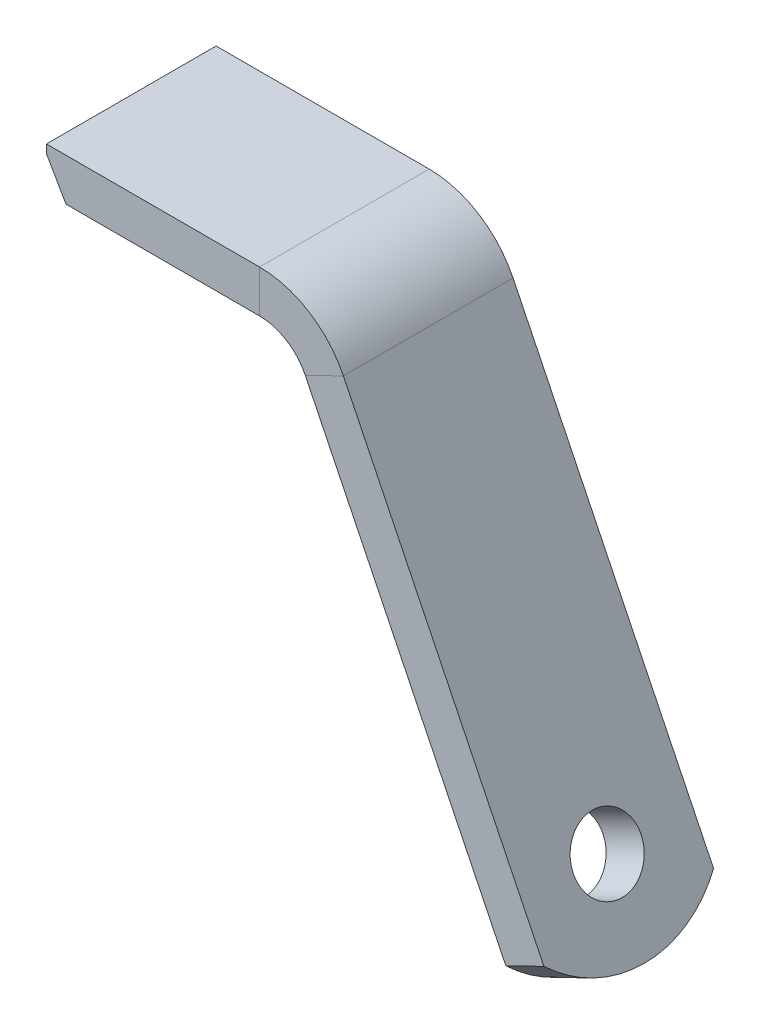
ISO-10303-21;
HEADER;
FILE_DESCRIPTION(('STEP AP214'),'2;1');
FILE_NAME('part.step','',(''),(''),'','','');
FILE_SCHEMA(('AUTOMOTIVE_DESIGN { 1 0 10303 214 1 1 1 1 }'));
ENDSEC;
DATA;
#1=APPLICATION_CONTEXT('core data for automotive mechanical design processes');
#2=APPLICATION_PROTOCOL_DEFINITION('international standard','automotive_design',2000,#1);
#3=PRODUCT_CONTEXT('',#1,'mechanical');
#4=PRODUCT('Part','Part','',(#3));
#5=PRODUCT_RELATED_PRODUCT_CATEGORY('part','',(#4));
#6=PRODUCT_DEFINITION_FORMATION('','',#4);
#7=PRODUCT_DEFINITION_CONTEXT('part definition',#1,'design');
#8=PRODUCT_DEFINITION('design','',#6,#7);
#9=PRODUCT_DEFINITION_SHAPE('','',#8);
#10=(LENGTH_UNIT() NAMED_UNIT(*) SI_UNIT(.MILLI.,.METRE.));
#11=(NAMED_UNIT(*) PLANE_ANGLE_UNIT() SI_UNIT($,.RADIAN.));
#12=(NAMED_UNIT(*) SI_UNIT($,.STERADIAN.) SOLID_ANGLE_UNIT());
#13=UNCERTAINTY_MEASURE_WITH_UNIT(LENGTH_MEASURE(1.E-05),#10,'distance_accuracy_value','');
#14=(GEOMETRIC_REPRESENTATION_CONTEXT(3) GLOBAL_UNCERTAINTY_ASSIGNED_CONTEXT((#13)) GLOBAL_UNIT_ASSIGNED_CONTEXT((#10,
#11,#12)) REPRESENTATION_CONTEXT('',''));
#15=CARTESIAN_POINT('',(0.,0.,0.));
#16=DIRECTION('',(0.,0.,1.));
#17=DIRECTION('',(1.,0.,0.));
#18=AXIS2_PLACEMENT_3D('',#15,#16,#17);
#19=CARTESIAN_POINT('',(27.5060297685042,-2.19185573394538,10.));
#20=DIRECTION('',(0.898794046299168,0.438371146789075,0.));
#21=DIRECTION('',(-0.438371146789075,0.898794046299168,0.));
#22=AXIS2_PLACEMENT_3D('',#19,#20,#21);
#23=PLANE('',#22);
#24=CARTESIAN_POINT('',(51.6164428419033,-51.6255282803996,0.));
#25=DIRECTION('',(0.898794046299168,0.438371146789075,0.));
#26=DIRECTION('',(-0.438371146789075,0.898794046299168,0.));
#27=AXIS2_PLACEMENT_3D('',#24,#25,#26);
#28=CIRCLE('',#27,4.);
#29=CARTESIAN_POINT('',(49.862958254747,-48.030352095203,0.));
#30=VERTEX_POINT('',#29);
#31=EDGE_CURVE('E124',#30,#30,#28,.T.);
#32=ORIENTED_EDGE('',*,*,#31,.T.);
#33=EDGE_LOOP('',(#32));
#34=FACE_BOUND('',#33,.T.);
#35=CARTESIAN_POINT('',(49.862958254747,-48.030352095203,0.));
#36=DIRECTION('',(0.898794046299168,0.438371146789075,0.));
#37=DIRECTION('',(-0.438371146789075,0.898794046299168,0.));
#38=AXIS2_PLACEMENT_3D('',#35,#36,#37);
#39=CIRCLE('',#38,14.);
#40=CARTESIAN_POINT('',(54.1581007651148,-56.8366992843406,-10.));
#41=VERTEX_POINT('',#40);
#42=CARTESIAN_POINT('',(54.1581007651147,-56.8366992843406,10.));
#43=VERTEX_POINT('',#42);
#44=EDGE_CURVE('E105',#41,#43,#39,.F.);
#45=ORIENTED_EDGE('',*,*,#44,.T.);
#46=DIRECTION('',(0.438371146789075,-0.898794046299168,0.));
#47=VECTOR('',#46,1.);
#48=CARTESIAN_POINT('',(27.5060297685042,-2.19185573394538,10.));
#49=LINE('',#48,#47);
#50=CARTESIAN_POINT('',(30.5192014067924,-8.36977311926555,10.));
#51=VERTEX_POINT('',#50);
#52=EDGE_CURVE('E109',#51,#43,#49,.T.);
#53=ORIENTED_EDGE('',*,*,#52,.F.);
#54=DIRECTION('',(0.,0.,-1.));
#55=VECTOR('',#54,1.);
#56=CARTESIAN_POINT('',(30.5192014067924,-8.36977311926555,10.));
#57=LINE('',#56,#55);
#58=CARTESIAN_POINT('',(30.5192014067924,-8.36977311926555,-10.));
#59=VERTEX_POINT('',#58);
#60=EDGE_CURVE('E151',#51,#59,#57,.T.);
#61=ORIENTED_EDGE('',*,*,#60,.T.);
#62=DIRECTION('',(0.438371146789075,-0.898794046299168,0.));
#63=VECTOR('',#62,1.);
#64=CARTESIAN_POINT('',(27.5060297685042,-2.19185573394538,-10.));
#65=LINE('',#64,#63);
#66=EDGE_CURVE('E111',#59,#41,#65,.T.);
#67=ORIENTED_EDGE('',*,*,#66,.T.);
#68=EDGE_LOOP('',(#45,#53,#61,#67));
#69=FACE_BOUND('',#68,.T.);
#70=ADVANCED_FACE('F36',(#34,#69),#23,.F.);
#71=CARTESIAN_POINT('',(32.,0.,10.));
#72=DIRECTION('',(0.898794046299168,0.438371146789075,0.));
#73=DIRECTION('',(-0.438371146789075,0.898794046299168,0.));
#74=AXIS2_PLACEMENT_3D('',#71,#72,#73);
#75=PLANE('',#74);
#76=CARTESIAN_POINT('',(56.1104130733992,-49.4336725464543,0.));
#77=DIRECTION('',(0.898794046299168,0.438371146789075,0.));
#78=DIRECTION('',(-0.438371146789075,0.898794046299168,0.));
#79=AXIS2_PLACEMENT_3D('',#76,#77,#78);
#80=CIRCLE('',#79,4.);
#81=CARTESIAN_POINT('',(54.3569284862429,-45.8384963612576,0.));
#82=VERTEX_POINT('',#81);
#83=EDGE_CURVE('E219',#82,#82,#80,.T.);
#84=ORIENTED_EDGE('',*,*,#83,.F.);
#85=EDGE_LOOP('',(#84));
#86=FACE_BOUND('',#85,.T.);
#87=DIRECTION('',(0.438371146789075,-0.898794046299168,0.));
#88=VECTOR('',#87,1.);
#89=CARTESIAN_POINT('',(32.,0.,10.));
#90=LINE('',#89,#88);
#91=CARTESIAN_POINT('',(35.0131716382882,-6.17791738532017,10.));
#92=VERTEX_POINT('',#91);
#93=CARTESIAN_POINT('',(58.6520709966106,-54.6448435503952,10.));
#94=VERTEX_POINT('',#93);
#95=EDGE_CURVE('E129',#92,#94,#90,.T.);
#96=ORIENTED_EDGE('',*,*,#95,.T.);
#97=CARTESIAN_POINT('',(54.3569284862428,-45.8384963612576,0.));
#98=DIRECTION('',(0.898794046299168,0.438371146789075,0.));
#99=DIRECTION('',(-0.438371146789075,0.898794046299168,0.));
#100=AXIS2_PLACEMENT_3D('',#97,#98,#99);
#101=CIRCLE('',#100,14.);
#102=CARTESIAN_POINT('',(58.6520709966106,-54.6448435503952,-10.));
#103=VERTEX_POINT('',#102);
#104=EDGE_CURVE('E115',#103,#94,#101,.F.);
#105=ORIENTED_EDGE('',*,*,#104,.F.);
#106=DIRECTION('',(0.438371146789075,-0.898794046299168,0.));
#107=VECTOR('',#106,1.);
#108=CARTESIAN_POINT('',(32.,0.,-10.));
#109=LINE('',#108,#107);
#110=CARTESIAN_POINT('',(35.0131716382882,-6.17791738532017,-10.));
#111=VERTEX_POINT('',#110);
#112=EDGE_CURVE('E153',#111,#103,#109,.T.);
#113=ORIENTED_EDGE('',*,*,#112,.F.);
#114=DIRECTION('',(0.,0.,-1.));
#115=VECTOR('',#114,1.);
#116=CARTESIAN_POINT('',(35.0131716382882,-6.17791738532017,10.));
#117=LINE('',#116,#115);
#118=EDGE_CURVE('E175',#92,#111,#117,.T.);
#119=ORIENTED_EDGE('',*,*,#118,.F.);
#120=EDGE_LOOP('',(#96,#105,#113,#119));
#121=FACE_BOUND('',#120,.T.);
#122=ADVANCED_FACE('F215',(#86,#121),#75,.T.);
#123=CARTESIAN_POINT('',(25.1264371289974,-5.,10.));
#124=DIRECTION('',(0.,0.,1.));
#125=DIRECTION('',(1.,0.,0.));
#126=AXIS2_PLACEMENT_3D('',#123,#124,#125);
#127=PLANE('',#126);
#128=ORIENTED_EDGE('',*,*,#52,.T.);
#129=DIRECTION('',(-0.898794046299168,-0.438371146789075,0.));
#130=VECTOR('',#129,1.);
#131=CARTESIAN_POINT('',(54.1581007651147,-56.8366992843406,10.));
#132=LINE('',#131,#130);
#133=EDGE_CURVE('E118',#43,#94,#132,.F.);
#134=ORIENTED_EDGE('',*,*,#133,.T.);
#135=ORIENTED_EDGE('',*,*,#95,.F.);
#136=DIRECTION('',(-0.898794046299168,-0.438371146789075,0.));
#137=VECTOR('',#136,1.);
#138=CARTESIAN_POINT('',(35.0131716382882,-6.17791738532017,10.));
#139=LINE('',#138,#137);
#140=EDGE_CURVE('E127',#92,#51,#139,.T.);
#141=ORIENTED_EDGE('',*,*,#140,.T.);
#142=EDGE_LOOP('',(#128,#134,#135,#141));
#143=FACE_BOUND('',#142,.T.);
#144=ADVANCED_FACE('F126',(#143),#127,.T.);
#145=CARTESIAN_POINT('',(25.1264371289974,-11.,-10.));
#146=DIRECTION('',(0.,0.,1.));
#147=DIRECTION('',(1.,0.,0.));
#148=AXIS2_PLACEMENT_3D('',#145,#146,#147);
#149=PLANE('',#148);
#150=DIRECTION('',(0.898794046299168,0.438371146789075,0.));
#151=VECTOR('',#150,1.);
#152=CARTESIAN_POINT('',(58.6520709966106,-54.6448435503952,-10.));
#153=LINE('',#152,#151);
#154=EDGE_CURVE('E114',#103,#41,#153,.F.);
#155=ORIENTED_EDGE('',*,*,#154,.T.);
#156=ORIENTED_EDGE('',*,*,#66,.F.);
#157=DIRECTION('',(0.898794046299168,0.438371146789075,0.));
#158=VECTOR('',#157,1.);
#159=CARTESIAN_POINT('',(30.5192014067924,-8.36977311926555,-10.));
#160=LINE('',#159,#158);
#161=EDGE_CURVE('E178',#59,#111,#160,.T.);
#162=ORIENTED_EDGE('',*,*,#161,.T.);
#163=ORIENTED_EDGE('',*,*,#112,.T.);
#164=EDGE_LOOP('',(#155,#156,#162,#163));
#165=FACE_BOUND('',#164,.T.);
#166=ADVANCED_FACE('F207',(#165),#149,.F.);
#167=CARTESIAN_POINT('',(35.0131716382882,-6.17791738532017,10.));
#168=DIRECTION('',(0.,0.,1.));
#169=DIRECTION('',(1.,0.,0.));
#170=AXIS2_PLACEMENT_3D('',#167,#168,#169);
#171=PLANE('',#170);
#172=ORIENTED_EDGE('',*,*,#140,.F.);
#173=CARTESIAN_POINT('',(25.1264371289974,-11.,10.));
#174=DIRECTION('',(0.,0.,1.));
#175=DIRECTION('',(1.,0.,0.));
#176=AXIS2_PLACEMENT_3D('',#173,#174,#175);
#177=CIRCLE('',#176,11.);
#178=CARTESIAN_POINT('',(25.1264371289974,0.,10.));
#179=VERTEX_POINT('',#178);
#180=EDGE_CURVE('E132',#179,#92,#177,.F.);
#181=ORIENTED_EDGE('',*,*,#180,.F.);
#182=DIRECTION('',(0.,1.,0.));
#183=VECTOR('',#182,1.);
#184=CARTESIAN_POINT('',(25.1264371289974,-5.,10.));
#185=LINE('',#184,#183);
#186=CARTESIAN_POINT('',(25.1264371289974,-5.,10.));
#187=VERTEX_POINT('',#186);
#188=EDGE_CURVE('E183',#187,#179,#185,.T.);
#189=ORIENTED_EDGE('',*,*,#188,.F.);
#190=CARTESIAN_POINT('',(25.1264371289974,-11.,10.));
#191=DIRECTION('',(0.,0.,1.));
#192=DIRECTION('',(1.,0.,0.));
#193=AXIS2_PLACEMENT_3D('',#190,#191,#192);
#194=CIRCLE('',#193,6.);
#195=EDGE_CURVE('E149',#187,#51,#194,.F.);
#196=ORIENTED_EDGE('',*,*,#195,.T.);
#197=EDGE_LOOP('',(#172,#181,#189,#196));
#198=FACE_BOUND('',#197,.T.);
#199=ADVANCED_FACE('F241',(#198),#171,.T.);
#200=CARTESIAN_POINT('',(25.1264371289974,0.,-10.));
#201=DIRECTION('',(0.,0.,-1.));
#202=DIRECTION('',(-1.,0.,0.));
#203=AXIS2_PLACEMENT_3D('',#200,#201,#202);
#204=PLANE('',#203);
#205=DIRECTION('',(0.,-1.,0.));
#206=VECTOR('',#205,1.);
#207=CARTESIAN_POINT('',(25.1264371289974,0.,-10.));
#208=LINE('',#207,#206);
#209=CARTESIAN_POINT('',(25.1264371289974,0.,-10.));
#210=VERTEX_POINT('',#209);
#211=CARTESIAN_POINT('',(25.1264371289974,-5.,-10.));
#212=VERTEX_POINT('',#211);
#213=EDGE_CURVE('E180',#210,#212,#208,.T.);
#214=ORIENTED_EDGE('',*,*,#213,.F.);
#215=CARTESIAN_POINT('',(25.1264371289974,-11.,-10.));
#216=DIRECTION('',(0.,0.,1.));
#217=DIRECTION('',(1.,0.,0.));
#218=AXIS2_PLACEMENT_3D('',#215,#216,#217);
#219=CIRCLE('',#218,11.);
#220=EDGE_CURVE('E156',#210,#111,#219,.F.);
#221=ORIENTED_EDGE('',*,*,#220,.T.);
#222=ORIENTED_EDGE('',*,*,#161,.F.);
#223=CARTESIAN_POINT('',(25.1264371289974,-11.,-10.));
#224=DIRECTION('',(0.,0.,1.));
#225=DIRECTION('',(1.,0.,0.));
#226=AXIS2_PLACEMENT_3D('',#223,#224,#225);
#227=CIRCLE('',#226,6.);
#228=EDGE_CURVE('E130',#212,#59,#227,.F.);
#229=ORIENTED_EDGE('',*,*,#228,.F.);
#230=EDGE_LOOP('',(#214,#221,#222,#229));
#231=FACE_BOUND('',#230,.T.);
#232=ADVANCED_FACE('F204',(#231),#204,.T.);
#233=CARTESIAN_POINT('',(30.5192014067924,-8.36977311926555,-10.));
#234=DIRECTION('',(0.,0.,-1.));
#235=DIRECTION('',(-1.,0.,0.));
#236=AXIS2_PLACEMENT_3D('',#233,#234,#235);
#237=PLANE('',#236);
#238=DIRECTION('',(1.,0.,0.));
#239=VECTOR('',#238,1.);
#240=CARTESIAN_POINT('',(0.,-5.,-10.));
#241=LINE('',#240,#239);
#242=CARTESIAN_POINT('',(2.30940107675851,-5.,-10.));
#243=VERTEX_POINT('',#242);
#244=EDGE_CURVE('E135',#243,#212,#241,.T.);
#245=ORIENTED_EDGE('',*,*,#244,.F.);
#246=DIRECTION('',(-0.499999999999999,0.86602540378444,0.));
#247=VECTOR('',#246,1.);
#248=CARTESIAN_POINT('',(10.8210057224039,-19.7425317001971,-10.));
#249=LINE('',#248,#247);
#250=CARTESIAN_POINT('',(0.,-0.999999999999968,-10.));
#251=VERTEX_POINT('',#250);
#252=EDGE_CURVE('E58',#243,#251,#249,.T.);
#253=ORIENTED_EDGE('',*,*,#252,.T.);
#254=DIRECTION('',(0.,1.,0.));
#255=VECTOR('',#254,1.);
#256=CARTESIAN_POINT('',(0.,-5.,-10.));
#257=LINE('',#256,#255);
#258=CARTESIAN_POINT('',(0.,0.,-10.));
#259=VERTEX_POINT('',#258);
#260=EDGE_CURVE('E162',#251,#259,#257,.T.);
#261=ORIENTED_EDGE('',*,*,#260,.T.);
#262=DIRECTION('',(1.,0.,0.));
#263=VECTOR('',#262,1.);
#264=CARTESIAN_POINT('',(0.,0.,-10.));
#265=LINE('',#264,#263);
#266=EDGE_CURVE('E159',#259,#210,#265,.T.);
#267=ORIENTED_EDGE('',*,*,#266,.T.);
#268=ORIENTED_EDGE('',*,*,#213,.T.);
#269=EDGE_LOOP('',(#245,#253,#261,#267,#268));
#270=FACE_BOUND('',#269,.T.);
#271=ADVANCED_FACE('F196',(#270),#237,.T.);
#272=CARTESIAN_POINT('',(25.1264371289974,-11.,10.));
#273=DIRECTION('',(0.,0.,-1.));
#274=DIRECTION('',(-1.,0.,0.));
#275=AXIS2_PLACEMENT_3D('',#272,#273,#274);
#276=CYLINDRICAL_SURFACE('',#275,11.);
#277=ORIENTED_EDGE('',*,*,#220,.F.);
#278=DIRECTION('',(0.,0.,-1.));
#279=VECTOR('',#278,1.);
#280=CARTESIAN_POINT('',(25.1264371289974,0.,10.));
#281=LINE('',#280,#279);
#282=EDGE_CURVE('E172',#179,#210,#281,.T.);
#283=ORIENTED_EDGE('',*,*,#282,.F.);
#284=ORIENTED_EDGE('',*,*,#180,.T.);
#285=ORIENTED_EDGE('',*,*,#118,.T.);
#286=EDGE_LOOP('',(#277,#283,#284,#285));
#287=FACE_BOUND('',#286,.T.);
#288=ADVANCED_FACE('F211',(#287),#276,.T.);
#289=CARTESIAN_POINT('',(0.,0.,10.));
#290=DIRECTION('',(0.,1.,0.));
#291=DIRECTION('',(0.,0.,1.));
#292=AXIS2_PLACEMENT_3D('',#289,#290,#291);
#293=PLANE('',#292);
#294=ORIENTED_EDGE('',*,*,#266,.F.);
#295=DIRECTION('',(0.,0.,-1.));
#296=VECTOR('',#295,1.);
#297=CARTESIAN_POINT('',(0.,0.,10.));
#298=LINE('',#297,#296);
#299=CARTESIAN_POINT('',(0.,0.,10.));
#300=VERTEX_POINT('',#299);
#301=EDGE_CURVE('E169',#300,#259,#298,.T.);
#302=ORIENTED_EDGE('',*,*,#301,.F.);
#303=DIRECTION('',(1.,0.,0.));
#304=VECTOR('',#303,1.);
#305=CARTESIAN_POINT('',(0.,0.,10.));
#306=LINE('',#305,#304);
#307=EDGE_CURVE('E142',#300,#179,#306,.T.);
#308=ORIENTED_EDGE('',*,*,#307,.T.);
#309=ORIENTED_EDGE('',*,*,#282,.T.);
#310=EDGE_LOOP('',(#294,#302,#308,#309));
#311=FACE_BOUND('',#310,.T.);
#312=ADVANCED_FACE('F253',(#311),#293,.T.);
#313=CARTESIAN_POINT('',(0.,-5.,10.));
#314=DIRECTION('',(-1.,0.,0.));
#315=DIRECTION('',(0.,0.,1.));
#316=AXIS2_PLACEMENT_3D('',#313,#314,#315);
#317=PLANE('',#316);
#318=ORIENTED_EDGE('',*,*,#260,.F.);
#319=DIRECTION('',(0.,0.,1.));
#320=VECTOR('',#319,1.);
#321=CARTESIAN_POINT('',(0.,-0.999999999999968,10.));
#322=LINE('',#321,#320);
#323=CARTESIAN_POINT('',(0.,-0.999999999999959,10.));
#324=VERTEX_POINT('',#323);
#325=EDGE_CURVE('E44',#251,#324,#322,.T.);
#326=ORIENTED_EDGE('',*,*,#325,.T.);
#327=DIRECTION('',(0.,1.,0.));
#328=VECTOR('',#327,1.);
#329=CARTESIAN_POINT('',(0.,-5.,10.));
#330=LINE('',#329,#328);
#331=EDGE_CURVE('E145',#324,#300,#330,.T.);
#332=ORIENTED_EDGE('',*,*,#331,.T.);
#333=ORIENTED_EDGE('',*,*,#301,.T.);
#334=EDGE_LOOP('',(#318,#326,#332,#333));
#335=FACE_BOUND('',#334,.T.);
#336=ADVANCED_FACE('F255',(#335),#317,.T.);
#337=CARTESIAN_POINT('',(0.,-5.,10.));
#338=DIRECTION('',(0.,1.,0.));
#339=DIRECTION('',(0.,0.,1.));
#340=AXIS2_PLACEMENT_3D('',#337,#338,#339);
#341=PLANE('',#340);
#342=DIRECTION('',(1.,0.,0.));
#343=VECTOR('',#342,1.);
#344=CARTESIAN_POINT('',(0.,-5.,10.));
#345=LINE('',#344,#343);
#346=CARTESIAN_POINT('',(2.30940107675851,-5.,10.));
#347=VERTEX_POINT('',#346);
#348=EDGE_CURVE('E147',#347,#187,#345,.T.);
#349=ORIENTED_EDGE('',*,*,#348,.F.);
#350=DIRECTION('',(0.,0.,-1.));
#351=VECTOR('',#350,1.);
#352=CARTESIAN_POINT('',(2.30940107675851,-5.,-10.));
#353=LINE('',#352,#351);
#354=EDGE_CURVE('E186',#347,#243,#353,.T.);
#355=ORIENTED_EDGE('',*,*,#354,.T.);
#356=ORIENTED_EDGE('',*,*,#244,.T.);
#357=DIRECTION('',(0.,0.,-1.));
#358=VECTOR('',#357,1.);
#359=CARTESIAN_POINT('',(25.1264371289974,-5.,10.));
#360=LINE('',#359,#358);
#361=EDGE_CURVE('E166',#187,#212,#360,.T.);
#362=ORIENTED_EDGE('',*,*,#361,.F.);
#363=EDGE_LOOP('',(#349,#355,#356,#362));
#364=FACE_BOUND('',#363,.T.);
#365=ADVANCED_FACE('F192',(#364),#341,.F.);
#366=CARTESIAN_POINT('',(25.1264371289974,-11.,10.));
#367=DIRECTION('',(0.,0.,-1.));
#368=DIRECTION('',(-1.,0.,0.));
#369=AXIS2_PLACEMENT_3D('',#366,#367,#368);
#370=CYLINDRICAL_SURFACE('',#369,6.);
#371=ORIENTED_EDGE('',*,*,#228,.T.);
#372=ORIENTED_EDGE('',*,*,#60,.F.);
#373=ORIENTED_EDGE('',*,*,#195,.F.);
#374=ORIENTED_EDGE('',*,*,#361,.T.);
#375=EDGE_LOOP('',(#371,#372,#373,#374));
#376=FACE_BOUND('',#375,.T.);
#377=ADVANCED_FACE('F202',(#376),#370,.F.);
#378=CARTESIAN_POINT('',(25.1264371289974,-11.,10.));
#379=DIRECTION('',(0.,0.,1.));
#380=DIRECTION('',(1.,0.,0.));
#381=AXIS2_PLACEMENT_3D('',#378,#379,#380);
#382=PLANE('',#381);
#383=ORIENTED_EDGE('',*,*,#331,.F.);
#384=DIRECTION('',(0.499999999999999,-0.86602540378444,0.));
#385=VECTOR('',#384,1.);
#386=CARTESIAN_POINT('',(10.6117363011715,-19.3800664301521,10.));
#387=LINE('',#386,#385);
#388=EDGE_CURVE('E11',#324,#347,#387,.T.);
#389=ORIENTED_EDGE('',*,*,#388,.T.);
#390=ORIENTED_EDGE('',*,*,#348,.T.);
#391=ORIENTED_EDGE('',*,*,#188,.T.);
#392=ORIENTED_EDGE('',*,*,#307,.F.);
#393=EDGE_LOOP('',(#383,#389,#390,#391,#392));
#394=FACE_BOUND('',#393,.T.);
#395=ADVANCED_FACE('F251',(#394),#382,.T.);
#396=CARTESIAN_POINT('',(54.3569284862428,-45.8384963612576,0.));
#397=DIRECTION('',(0.898794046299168,0.438371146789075,0.));
#398=DIRECTION('',(-0.438371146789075,0.898794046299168,0.));
#399=AXIS2_PLACEMENT_3D('',#396,#397,#398);
#400=CYLINDRICAL_SURFACE('',#399,14.);
#401=ORIENTED_EDGE('',*,*,#104,.T.);
#402=ORIENTED_EDGE('',*,*,#133,.F.);
#403=ORIENTED_EDGE('',*,*,#44,.F.);
#404=ORIENTED_EDGE('',*,*,#154,.F.);
#405=EDGE_LOOP('',(#401,#402,#403,#404));
#406=FACE_BOUND('',#405,.T.);
#407=ADVANCED_FACE('F119',(#406),#400,.T.);
#408=CARTESIAN_POINT('',(6.37779687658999,-73.6898901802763,0.));
#409=DIRECTION('',(0.898794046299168,0.438371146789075,0.));
#410=DIRECTION('',(-0.438371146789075,0.898794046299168,0.));
#411=AXIS2_PLACEMENT_3D('',#408,#409,#410);
#412=CYLINDRICAL_SURFACE('',#411,4.);
#413=ORIENTED_EDGE('',*,*,#83,.T.);
#414=EDGE_LOOP('',(#413));
#415=FACE_BOUND('',#414,.T.);
#416=ORIENTED_EDGE('',*,*,#31,.F.);
#417=EDGE_LOOP('',(#416));
#418=FACE_BOUND('',#417,.T.);
#419=ADVANCED_FACE('F223',(#415,#418),#412,.F.);
#420=CARTESIAN_POINT('',(2.30940107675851,-5.,10.));
#421=DIRECTION('',(-0.86602540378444,-0.499999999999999,0.));
#422=DIRECTION('',(0.,0.,1.));
#423=AXIS2_PLACEMENT_3D('',#420,#421,#422);
#424=PLANE('',#423);
#425=ORIENTED_EDGE('',*,*,#388,.F.);
#426=ORIENTED_EDGE('',*,*,#325,.F.);
#427=ORIENTED_EDGE('',*,*,#252,.F.);
#428=ORIENTED_EDGE('',*,*,#354,.F.);
#429=EDGE_LOOP('',(#425,#426,#427,#428));
#430=FACE_BOUND('',#429,.T.);
#431=ADVANCED_FACE('F38',(#430),#424,.T.);
#432=CLOSED_SHELL('',(#70,#122,#144,#166,#199,#232,#271,#288,#312,#336,#365,#377,#395,#407,#419,#431));
#433=MANIFOLD_SOLID_BREP('B2',#432);
#434=ADVANCED_BREP_SHAPE_REPRESENTATION('',(#18,#433),#14);
#435=SHAPE_DEFINITION_REPRESENTATION(#9,#434);
ENDSEC;
END-ISO-10303-21;
